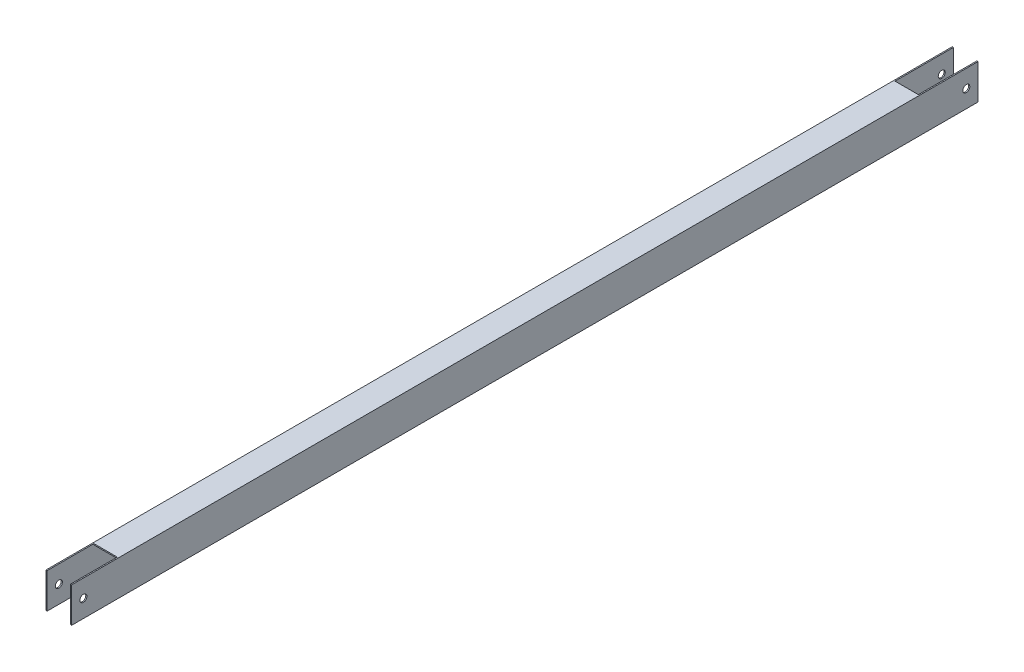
from build123d import *

# Parameters (mm, degrees)
ESQUISSE1_W             = 44
ESQUISSE1_H             = 60
ESQUISSE1_W_2           = 40
ESQUISSE1_H_2           = 56
ESQUISSE4_W             = 40
ESQUISSE4_H             = 60
ENL_V_MAT_EXTRU_1_DEPTH = 80
D_GAGEMENT_M101_D       = 12
ESQUISSE6_W             = 2
ESQUISSE6_H             = 60
BOSS_EXTRU_1_DEPTH      = 100
D_GAGEMENT_M102_D       = 12


with BuildPart() as part:
    # Balayage1: sweep along a path in Esquisse2
    with BuildLine(Plane(origin=(0, 0, 0), x_dir=(1, 0, 0), z_dir=(0, 1, 0))) as balayage1_path:
        Line((0, 0), (0, 1450))
    # Esquisse1 → Balayage1 (sweep)
    with BuildSketch(Plane.XY):
        Rectangle(ESQUISSE1_W, ESQUISSE1_H)
        Rectangle(ESQUISSE1_W_2, ESQUISSE1_H_2, mode=Mode.SUBTRACT)
    sweep(path=balayage1_path.line)

    # Esquisse4 → Enl_v. mat.-Extru.1 (cut)
    with BuildSketch(Plane.XY):
        Rectangle(ESQUISSE4_W, ESQUISSE4_H)
    extrude(amount=-ENL_V_MAT_EXTRU_1_DEPTH, mode=Mode.SUBTRACT)

    # D_gagement M101 (through all)
    with Locations(Plane(origin=(22, 0, -20), x_dir=(0, 1, 0), z_dir=(1, 0, 0))):
        with Locations((0, 0)):
            Hole(D_GAGEMENT_M101_D / 2)

    # Esquisse6 → Boss.-Extru.1 (add)
    with BuildSketch(Plane(origin=(0, 0, -1450), x_dir=(-1, 0, 0), z_dir=(0, 0, -1))):
        with Locations((-21, 0)):
            Rectangle(ESQUISSE6_W, ESQUISSE6_H)
        with Locations((21, 0)):
            Rectangle(ESQUISSE6_W, ESQUISSE6_H)
    extrude(amount=BOSS_EXTRU_1_DEPTH)

    # D_gagement M102 (through all)
    with Locations(Plane(origin=(-22, 0, -1530), x_dir=(0, -1, 0), z_dir=(-1, 0, 0))):
        with Locations((0, 0)):
            Hole(D_GAGEMENT_M102_D / 2)


solid = part.part
